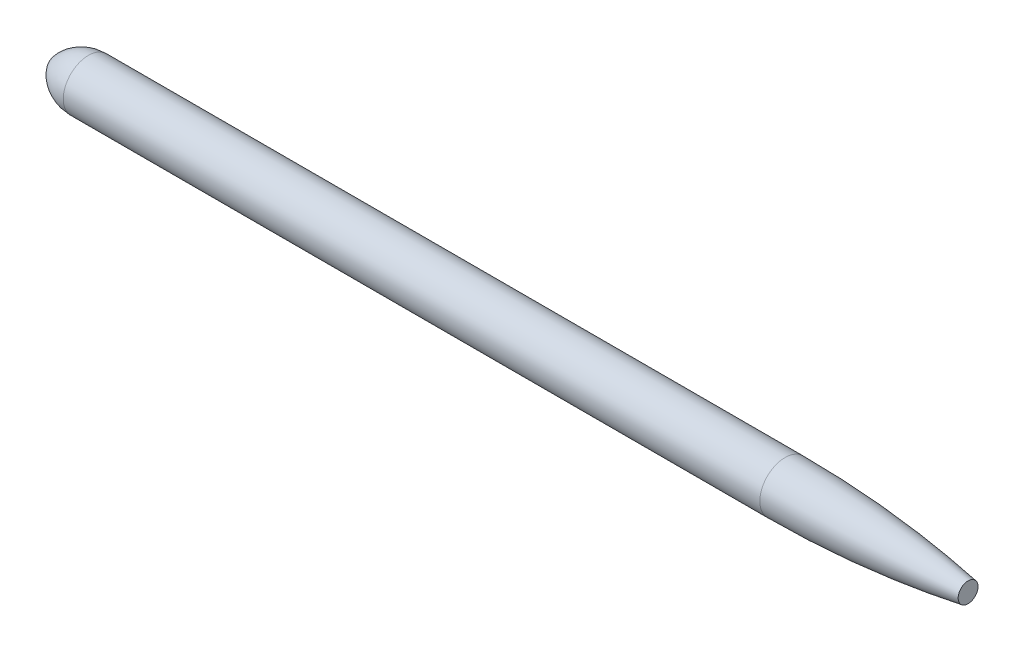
from build123d import *


with BuildPart() as part:
    # rootSketch → Revolve1 (revolve)
    with BuildSketch(Plane(origin=(0, 0, 0), x_dir=(1, 0, 0), z_dir=(0, 1, 0))):
        with BuildLine():
            Line((0, 0), (6470, 0))
            Line((6470, 0), (6470, -70))
            ThreePointArc((6470, -70), (5827.248182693, -150.803113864), (5180, -177.8))
            Line((5180, -177.8), (270, -177.8))
            ThreePointArc((270, -177.8), (108.357771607, -129.357827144), (0, 0))
        make_face()
    revolve(axis=Axis((0, 0, 0), (1, 0, 0)))


solid = part.part
